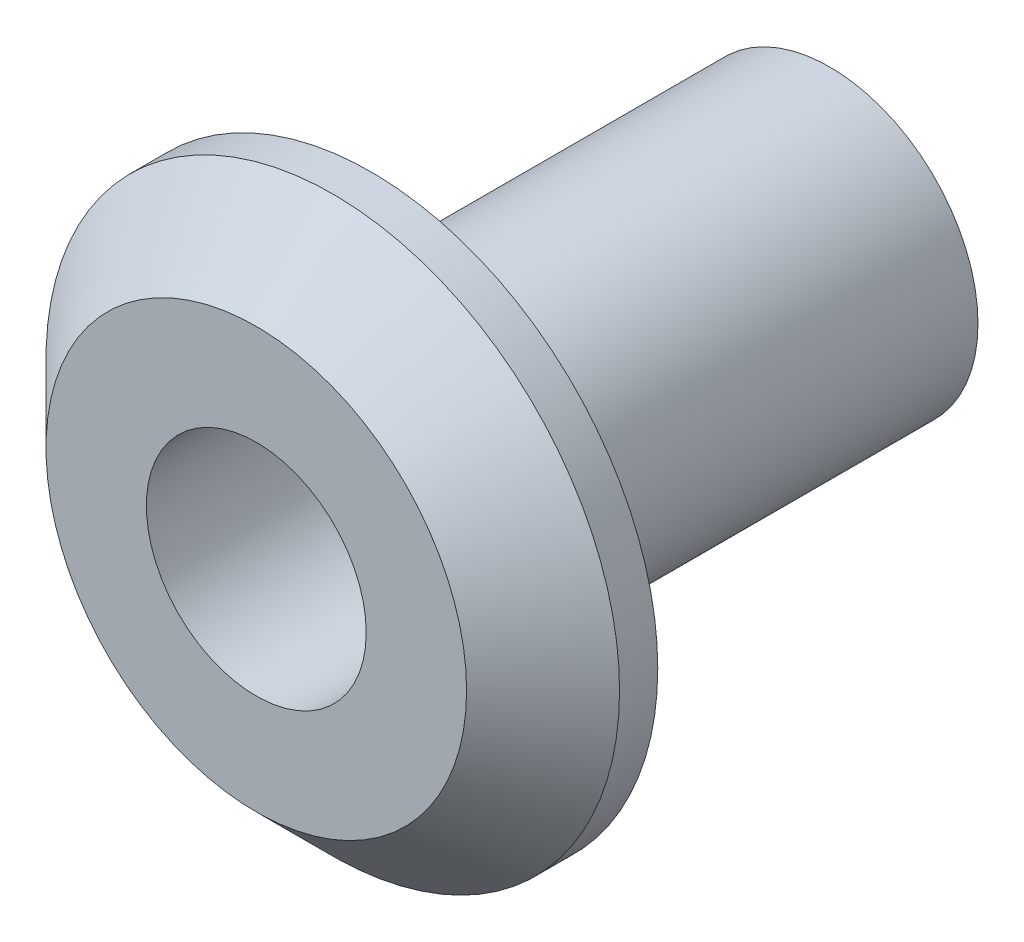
ISO-10303-21;
HEADER;
FILE_DESCRIPTION(('STEP AP214'),'2;1');
FILE_NAME('part.step','',(''),(''),'','','');
FILE_SCHEMA(('AUTOMOTIVE_DESIGN { 1 0 10303 214 1 1 1 1 }'));
ENDSEC;
DATA;
#1=APPLICATION_CONTEXT('core data for automotive mechanical design processes');
#2=APPLICATION_PROTOCOL_DEFINITION('international standard','automotive_design',2000,#1);
#3=PRODUCT_CONTEXT('',#1,'mechanical');
#4=PRODUCT('Part','Part','',(#3));
#5=PRODUCT_RELATED_PRODUCT_CATEGORY('part','',(#4));
#6=PRODUCT_DEFINITION_FORMATION('','',#4);
#7=PRODUCT_DEFINITION_CONTEXT('part definition',#1,'design');
#8=PRODUCT_DEFINITION('design','',#6,#7);
#9=PRODUCT_DEFINITION_SHAPE('','',#8);
#10=(LENGTH_UNIT() NAMED_UNIT(*) SI_UNIT(.MILLI.,.METRE.));
#11=(NAMED_UNIT(*) PLANE_ANGLE_UNIT() SI_UNIT($,.RADIAN.));
#12=(NAMED_UNIT(*) SI_UNIT($,.STERADIAN.) SOLID_ANGLE_UNIT());
#13=UNCERTAINTY_MEASURE_WITH_UNIT(LENGTH_MEASURE(1.E-05),#10,'distance_accuracy_value','');
#14=(GEOMETRIC_REPRESENTATION_CONTEXT(3) GLOBAL_UNCERTAINTY_ASSIGNED_CONTEXT((#13)) GLOBAL_UNIT_ASSIGNED_CONTEXT((#10,
#11,#12)) REPRESENTATION_CONTEXT('',''));
#15=CARTESIAN_POINT('',(0.,0.,0.));
#16=DIRECTION('',(0.,0.,1.));
#17=DIRECTION('',(1.,0.,0.));
#18=AXIS2_PLACEMENT_3D('',#15,#16,#17);
#19=CARTESIAN_POINT('',(0.,0.,-1.5));
#20=DIRECTION('',(0.,0.,1.));
#21=DIRECTION('',(1.,0.,0.));
#22=AXIS2_PLACEMENT_3D('',#19,#20,#21);
#23=PLANE('',#22);
#24=CARTESIAN_POINT('',(0.,0.,-1.5));
#25=DIRECTION('',(0.,0.,1.));
#26=DIRECTION('',(1.,0.,0.));
#27=AXIS2_PLACEMENT_3D('',#24,#25,#26);
#28=CIRCLE('',#27,7.5);
#29=CARTESIAN_POINT('',(7.5,0.,-1.5));
#30=VERTEX_POINT('',#29);
#31=EDGE_CURVE('E56',#30,#30,#28,.T.);
#32=ORIENTED_EDGE('',*,*,#31,.F.);
#33=EDGE_LOOP('',(#32));
#34=FACE_BOUND('',#33,.T.);
#35=CARTESIAN_POINT('',(0.,0.,-1.5));
#36=DIRECTION('',(0.,0.,1.));
#37=DIRECTION('',(1.,0.,0.));
#38=AXIS2_PLACEMENT_3D('',#35,#36,#37);
#39=CIRCLE('',#38,3.875);
#40=CARTESIAN_POINT('',(3.875,0.,-1.5));
#41=VERTEX_POINT('',#40);
#42=EDGE_CURVE('E11',#41,#41,#39,.F.);
#43=ORIENTED_EDGE('',*,*,#42,.F.);
#44=EDGE_LOOP('',(#43));
#45=FACE_BOUND('',#44,.T.);
#46=ADVANCED_FACE('F38',(#34,#45),#23,.F.);
#47=CARTESIAN_POINT('',(0.,0.,1.5));
#48=DIRECTION('',(0.,0.,1.));
#49=DIRECTION('',(1.,0.,0.));
#50=AXIS2_PLACEMENT_3D('',#47,#48,#49);
#51=PLANE('',#50);
#52=CARTESIAN_POINT('',(0.,0.,1.5));
#53=DIRECTION('',(0.,0.,1.));
#54=DIRECTION('',(1.,0.,0.));
#55=AXIS2_PLACEMENT_3D('',#52,#53,#54);
#56=CIRCLE('',#55,2.875);
#57=CARTESIAN_POINT('',(2.875,0.,1.5));
#58=VERTEX_POINT('',#57);
#59=EDGE_CURVE('E68',#58,#58,#56,.T.);
#60=ORIENTED_EDGE('',*,*,#59,.F.);
#61=EDGE_LOOP('',(#60));
#62=FACE_BOUND('',#61,.T.);
#63=CARTESIAN_POINT('',(0.,0.,1.5));
#64=DIRECTION('',(0.,0.,1.));
#65=DIRECTION('',(1.,0.,0.));
#66=AXIS2_PLACEMENT_3D('',#63,#64,#65);
#67=CIRCLE('',#66,5.5);
#68=CARTESIAN_POINT('',(5.5,0.,1.5));
#69=VERTEX_POINT('',#68);
#70=EDGE_CURVE('E51',#69,#69,#67,.T.);
#71=ORIENTED_EDGE('',*,*,#70,.T.);
#72=EDGE_LOOP('',(#71));
#73=FACE_BOUND('',#72,.T.);
#74=ADVANCED_FACE('F75',(#62,#73),#51,.T.);
#75=CARTESIAN_POINT('',(0.,0.,1.5));
#76=DIRECTION('',(0.,0.,-1.));
#77=DIRECTION('',(-1.,0.,0.));
#78=AXIS2_PLACEMENT_3D('',#75,#76,#77);
#79=CYLINDRICAL_SURFACE('',#78,7.5);
#80=CARTESIAN_POINT('',(0.,0.,-0.500000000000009));
#81=DIRECTION('',(0.,0.,1.));
#82=DIRECTION('',(1.,0.,0.));
#83=AXIS2_PLACEMENT_3D('',#80,#81,#82);
#84=CIRCLE('',#83,7.5);
#85=CARTESIAN_POINT('',(7.5,0.,-0.500000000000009));
#86=VERTEX_POINT('',#85);
#87=EDGE_CURVE('E47',#86,#86,#84,.F.);
#88=ORIENTED_EDGE('',*,*,#87,.T.);
#89=EDGE_LOOP('',(#88));
#90=FACE_BOUND('',#89,.T.);
#91=ORIENTED_EDGE('',*,*,#31,.T.);
#92=EDGE_LOOP('',(#91));
#93=FACE_BOUND('',#92,.T.);
#94=ADVANCED_FACE('F78',(#90,#93),#79,.T.);
#95=CARTESIAN_POINT('',(0.,0.,1.5));
#96=DIRECTION('',(0.,0.,-1.));
#97=DIRECTION('',(-1.,0.,0.));
#98=AXIS2_PLACEMENT_3D('',#95,#96,#97);
#99=CYLINDRICAL_SURFACE('',#98,1.55);
#100=CARTESIAN_POINT('',(0.,0.,-10.5));
#101=DIRECTION('',(0.,0.,-1.));
#102=DIRECTION('',(-1.,0.,0.));
#103=AXIS2_PLACEMENT_3D('',#100,#101,#102);
#104=CIRCLE('',#103,1.55);
#105=CARTESIAN_POINT('',(-1.55,0.,-10.5));
#106=VERTEX_POINT('',#105);
#107=EDGE_CURVE('E43',#106,#106,#104,.T.);
#108=ORIENTED_EDGE('',*,*,#107,.F.);
#109=EDGE_LOOP('',(#108));
#110=FACE_BOUND('',#109,.T.);
#111=CARTESIAN_POINT('',(0.,0.,-13.5));
#112=DIRECTION('',(0.,0.,-1.));
#113=DIRECTION('',(-1.,0.,0.));
#114=AXIS2_PLACEMENT_3D('',#111,#112,#113);
#115=CIRCLE('',#114,1.55);
#116=CARTESIAN_POINT('',(-1.55,0.,-13.5));
#117=VERTEX_POINT('',#116);
#118=EDGE_CURVE('E62',#117,#117,#115,.T.);
#119=ORIENTED_EDGE('',*,*,#118,.T.);
#120=EDGE_LOOP('',(#119));
#121=FACE_BOUND('',#120,.T.);
#122=ADVANCED_FACE('F84',(#110,#121),#99,.F.);
#123=CARTESIAN_POINT('',(0.,0.,1.5));
#124=DIRECTION('',(0.,0.,-1.));
#125=DIRECTION('',(-1.,0.,0.));
#126=AXIS2_PLACEMENT_3D('',#123,#124,#125);
#127=CONICAL_SURFACE('',#126,5.5,0.785398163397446);
#128=ORIENTED_EDGE('',*,*,#87,.F.);
#129=EDGE_LOOP('',(#128));
#130=FACE_BOUND('',#129,.T.);
#131=ORIENTED_EDGE('',*,*,#70,.F.);
#132=EDGE_LOOP('',(#131));
#133=FACE_BOUND('',#132,.T.);
#134=ADVANCED_FACE('F41',(#130,#133),#127,.T.);
#135=CARTESIAN_POINT('',(0.,0.,-13.5));
#136=DIRECTION('',(0.,0.,-1.));
#137=DIRECTION('',(-1.,0.,0.));
#138=AXIS2_PLACEMENT_3D('',#135,#136,#137);
#139=PLANE('',#138);
#140=CARTESIAN_POINT('',(0.,0.,-13.5));
#141=DIRECTION('',(0.,0.,-1.));
#142=DIRECTION('',(-1.,0.,0.));
#143=AXIS2_PLACEMENT_3D('',#140,#141,#142);
#144=CIRCLE('',#143,3.875);
#145=CARTESIAN_POINT('',(-3.875,0.,-13.5));
#146=VERTEX_POINT('',#145);
#147=EDGE_CURVE('E59',#146,#146,#144,.T.);
#148=ORIENTED_EDGE('',*,*,#147,.T.);
#149=EDGE_LOOP('',(#148));
#150=FACE_BOUND('',#149,.T.);
#151=ORIENTED_EDGE('',*,*,#118,.F.);
#152=EDGE_LOOP('',(#151));
#153=FACE_BOUND('',#152,.T.);
#154=ADVANCED_FACE('F83',(#150,#153),#139,.T.);
#155=CARTESIAN_POINT('',(0.,0.,-13.5));
#156=DIRECTION('',(0.,0.,1.));
#157=DIRECTION('',(1.,0.,0.));
#158=AXIS2_PLACEMENT_3D('',#155,#156,#157);
#159=CYLINDRICAL_SURFACE('',#158,3.875);
#160=ORIENTED_EDGE('',*,*,#147,.F.);
#161=EDGE_LOOP('',(#160));
#162=FACE_BOUND('',#161,.T.);
#163=ORIENTED_EDGE('',*,*,#42,.T.);
#164=EDGE_LOOP('',(#163));
#165=FACE_BOUND('',#164,.T.);
#166=ADVANCED_FACE('F90',(#162,#165),#159,.T.);
#167=CARTESIAN_POINT('',(0.,0.,-10.5));
#168=DIRECTION('',(0.,0.,-1.));
#169=DIRECTION('',(-1.,0.,0.));
#170=AXIS2_PLACEMENT_3D('',#167,#168,#169);
#171=PLANE('',#170);
#172=ORIENTED_EDGE('',*,*,#107,.T.);
#173=EDGE_LOOP('',(#172));
#174=FACE_BOUND('',#173,.T.);
#175=CARTESIAN_POINT('',(0.,0.,-10.5));
#176=DIRECTION('',(0.,0.,-1.));
#177=DIRECTION('',(-1.,0.,0.));
#178=AXIS2_PLACEMENT_3D('',#175,#176,#177);
#179=CIRCLE('',#178,2.875);
#180=CARTESIAN_POINT('',(2.875,0.,-10.5));
#181=VERTEX_POINT('',#180);
#182=EDGE_CURVE('E65',#181,#181,#179,.F.);
#183=ORIENTED_EDGE('',*,*,#182,.T.);
#184=EDGE_LOOP('',(#183));
#185=FACE_BOUND('',#184,.T.);
#186=ADVANCED_FACE('F125',(#174,#185),#171,.F.);
#187=CARTESIAN_POINT('',(0.,0.,-21.6317279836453));
#188=DIRECTION('',(0.,0.,1.));
#189=DIRECTION('',(1.,0.,0.));
#190=AXIS2_PLACEMENT_3D('',#187,#188,#189);
#191=CYLINDRICAL_SURFACE('',#190,2.875);
#192=CARTESIAN_POINT('',(2.875,0.,1.5));
#193=CARTESIAN_POINT('',(2.875,0.,1.375));
#194=CARTESIAN_POINT('',(2.875,0.,1.25));
#195=CARTESIAN_POINT('',(2.875,0.,1.));
#196=CARTESIAN_POINT('',(2.875,0.,0.875000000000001));
#197=CARTESIAN_POINT('',(2.875,0.,0.625000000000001));
#198=CARTESIAN_POINT('',(2.875,0.,0.5));
#199=CARTESIAN_POINT('',(2.875,0.,0.25));
#200=CARTESIAN_POINT('',(2.875,0.,0.125));
#201=CARTESIAN_POINT('',(2.875,0.,-0.125));
#202=CARTESIAN_POINT('',(2.875,0.,-0.25));
#203=CARTESIAN_POINT('',(2.875,0.,-0.5));
#204=CARTESIAN_POINT('',(2.875,0.,-0.625000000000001));
#205=CARTESIAN_POINT('',(2.875,0.,-0.875));
#206=CARTESIAN_POINT('',(2.875,0.,-0.999999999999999));
#207=CARTESIAN_POINT('',(2.875,0.,-1.25));
#208=CARTESIAN_POINT('',(2.875,0.,-1.375));
#209=CARTESIAN_POINT('',(2.875,0.,-1.625));
#210=CARTESIAN_POINT('',(2.875,0.,-1.75));
#211=CARTESIAN_POINT('',(2.875,0.,-2.));
#212=CARTESIAN_POINT('',(2.875,0.,-2.125));
#213=CARTESIAN_POINT('',(2.875,0.,-2.375));
#214=CARTESIAN_POINT('',(2.875,0.,-2.5));
#215=CARTESIAN_POINT('',(2.875,0.,-2.75));
#216=CARTESIAN_POINT('',(2.875,0.,-2.875));
#217=CARTESIAN_POINT('',(2.875,0.,-3.125));
#218=CARTESIAN_POINT('',(2.875,0.,-3.25));
#219=CARTESIAN_POINT('',(2.875,0.,-3.5));
#220=CARTESIAN_POINT('',(2.875,0.,-3.625));
#221=CARTESIAN_POINT('',(2.875,0.,-3.875));
#222=CARTESIAN_POINT('',(2.875,0.,-4.));
#223=CARTESIAN_POINT('',(2.875,0.,-4.25));
#224=CARTESIAN_POINT('',(2.875,0.,-4.375));
#225=CARTESIAN_POINT('',(2.875,0.,-4.625));
#226=CARTESIAN_POINT('',(2.875,0.,-4.75));
#227=CARTESIAN_POINT('',(2.875,0.,-5.));
#228=CARTESIAN_POINT('',(2.875,0.,-5.125));
#229=CARTESIAN_POINT('',(2.875,0.,-5.375));
#230=CARTESIAN_POINT('',(2.875,0.,-5.5));
#231=CARTESIAN_POINT('',(2.875,0.,-5.75));
#232=CARTESIAN_POINT('',(2.875,0.,-5.875));
#233=CARTESIAN_POINT('',(2.875,0.,-6.125));
#234=CARTESIAN_POINT('',(2.875,0.,-6.25));
#235=CARTESIAN_POINT('',(2.875,0.,-6.5));
#236=CARTESIAN_POINT('',(2.875,0.,-6.625));
#237=CARTESIAN_POINT('',(2.875,0.,-6.875));
#238=CARTESIAN_POINT('',(2.875,0.,-7.));
#239=CARTESIAN_POINT('',(2.875,0.,-7.25));
#240=CARTESIAN_POINT('',(2.875,0.,-7.375));
#241=CARTESIAN_POINT('',(2.875,0.,-7.625));
#242=CARTESIAN_POINT('',(2.875,0.,-7.75));
#243=CARTESIAN_POINT('',(2.875,0.,-8.));
#244=CARTESIAN_POINT('',(2.875,0.,-8.125));
#245=CARTESIAN_POINT('',(2.875,0.,-8.375));
#246=CARTESIAN_POINT('',(2.875,0.,-8.5));
#247=CARTESIAN_POINT('',(2.875,0.,-8.75));
#248=CARTESIAN_POINT('',(2.875,0.,-8.875));
#249=CARTESIAN_POINT('',(2.875,0.,-9.125));
#250=CARTESIAN_POINT('',(2.875,0.,-9.25));
#251=CARTESIAN_POINT('',(2.875,0.,-9.5));
#252=CARTESIAN_POINT('',(2.875,0.,-9.625));
#253=CARTESIAN_POINT('',(2.875,0.,-9.875));
#254=CARTESIAN_POINT('',(2.875,0.,-10.));
#255=CARTESIAN_POINT('',(2.875,0.,-10.25));
#256=CARTESIAN_POINT('',(2.875,0.,-10.375));
#257=CARTESIAN_POINT('',(2.875,0.,-10.5));
#258=B_SPLINE_CURVE_WITH_KNOTS('',3,(#192,#193,#194,#195,#196,#197,#198,#199,#200,#201,#202,
#203,#204,#205,#206,#207,#208,#209,#210,#211,#212,#213,#214,#215,#216,#217,#218,#219,#220,#221,
#222,#223,#224,#225,#226,#227,#228,#229,#230,#231,#232,#233,#234,#235,#236,#237,#238,#239,#240,
#241,#242,#243,#244,#245,#246,#247,#248,#249,#250,#251,#252,#253,#254,#255,#256,#257),
.UNSPECIFIED.,.F.,.F.,(4,2,2,2,2,2,2,2,2,2,2,2,2,2,2,2,2,2,2,2,2,2,2,2,2,2,2,2,2,2,2,2,4),(0.,
0.375,0.750000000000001,1.125,1.5,1.875,2.25,2.625,3.,3.375,3.75,4.125,4.5,4.875,5.25,5.625,6.,
6.375,6.75,7.125,7.5,7.875,8.25,8.625,9.,9.375,9.75,10.125,10.5,10.875,11.25,11.625,12.),.UNSPECIFIED.);
#259=EDGE_CURVE('BSEAM72',#58,#181,#258,.T.);
#260=ORIENTED_EDGE('',*,*,#59,.T.);
#261=ORIENTED_EDGE('',*,*,#182,.F.);
#262=ORIENTED_EDGE('',*,*,#259,.T.);
#263=ORIENTED_EDGE('',*,*,#259,.F.);
#264=EDGE_LOOP('',(#260,#262,#261,#263));
#265=FACE_BOUND('',#264,.T.);
#266=ADVANCED_FACE('F72',(#265),#191,.F.);
#267=CLOSED_SHELL('',(#46,#74,#94,#122,#134,#154,#166,#186,#266));
#268=MANIFOLD_SOLID_BREP('B2',#267);
#269=ADVANCED_BREP_SHAPE_REPRESENTATION('',(#18,#268),#14);
#270=SHAPE_DEFINITION_REPRESENTATION(#9,#269);
ENDSEC;
END-ISO-10303-21;
